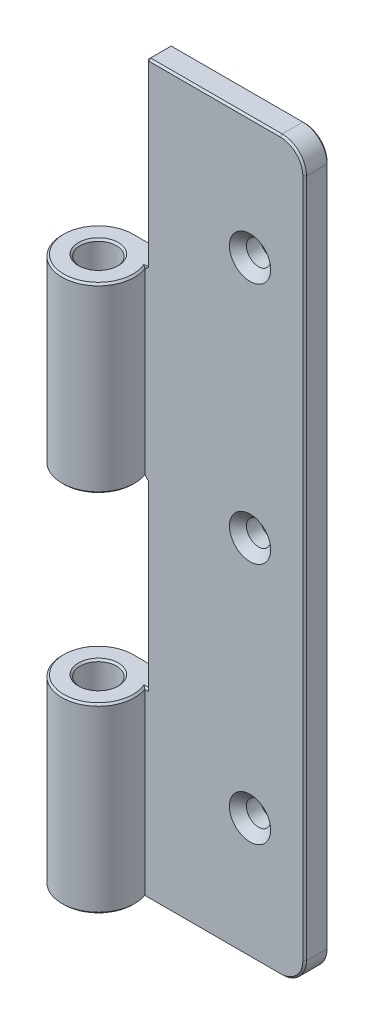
from build123d import *
from build123d.topology import SkipClean

# Parameters (mm, degrees)
SKETCH_1_R          = 3
SKETCH_1_R_2        = 1.5
EXTRUDE_1_DEPTH     = 45
SKETCH_2_W          = 6
SKETCH_2_H          = 15
CUT_EXTRUDE_1_DEPTH = 5
EXTRUDE_2_DEPTH     = 60
SKETCH_6_R          = 1
SKETCH_6_W          = 6
SKETCH_6_H          = 15
CUT_EXTRUDE_2_DEPTH = 5
FILLET_1_R          = 2
CHAMFER_1_SIZE      = 0.7
CHAMFER_2_SIZE      = 0.15


with BuildPart() as part:
    # Sketch 1 → Extrude 1 (new body)
    with BuildSketch(Plane(origin=(0, 0, 0), x_dir=(1, 0, 0), z_dir=(0, 1, 0))):
        with Locations(Location((0, 0, 0), (0, 0, 90))):
            Circle(SKETCH_1_R)
        with Locations(Location((0, 0, 0), (0, 0, 90))):
            Circle(SKETCH_1_R_2, mode=Mode.SUBTRACT)
    extrude(amount=EXTRUDE_1_DEPTH)

    # Sketch 2 → Cut-Extrude 1 (cut, symmetric)
    with BuildSketch(Plane.XY):
        with Locations((0, 22.5)):
            Rectangle(SKETCH_2_W, SKETCH_2_H)
    extrude(amount=CUT_EXTRUDE_1_DEPTH, both=True, mode=Mode.SUBTRACT)


with BuildPart() as cut_extrude_1_piece_1:
    # of the separate pieces the step leaves, piece 1, a body of its own (cut_extrude_1_pieces)
    add(part.part.solids().sort_by_distance((0, 0, -3))[0])



with BuildPart() as cut_extrude_1_piece_2:
    # of the separate pieces the step leaves, piece 2, a body of its own (cut_extrude_1_pieces)
    add(part.part.solids().sort_by_distance((0, 30, -3))[0])


with BuildPart() as cut_extrude_1_piece_1_1:
    with SkipClean():  # the faces are left unmerged after this step: merging them gives an invalid solid
        add(cut_extrude_1_piece_1.part)

        add(cut_extrude_1_piece_2.part)  # Extrude 2 merges Cut-Extrude 1 piece 2
        # Sketch 4 → Extrude 2 (add)
        with BuildSketch(Plane(origin=(0, 0, 0), x_dir=(1, 0, 0), z_dir=(0, 1, 0))):
            with BuildLine():
                Line((0, 3), (16, 3))
                Line((16, 3), (16, 1))
                Line((16, 1), (1.118033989, 1))
                ThreePointArc((1.118033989, 1), (0.612372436, 1.369306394), (0, 1.5))
                Line((0, 1.5), (0, 3))
            make_face()
        extrude(amount=EXTRUDE_2_DEPTH)

    # Sketch 6 → Cut-Extrude 2 (cut, symmetric)
    with BuildSketch(Plane.XY):
        with Locations((11.5, 50)):
            Circle(SKETCH_6_R)
        with Locations((11.5, 30)):
            Circle(SKETCH_6_R)
        with Locations((11.5, 10)):
            Circle(SKETCH_6_R)
        with Locations((0, 52.5)):
            Rectangle(SKETCH_6_W, SKETCH_6_H)
        with Locations((0, 22.5)):
            Rectangle(SKETCH_6_W, SKETCH_6_H)
    extrude(amount=CUT_EXTRUDE_2_DEPTH, both=True, mode=Mode.SUBTRACT)

    # Fillet 1
    fillet_1_edges = [cut_extrude_1_piece_1_1.edges().sort_by_distance(p)[0] for p in [
        (16, 0, -2),
        (16, 60, -2),
    ]]
    fillet(fillet_1_edges, radius=FILLET_1_R)

    # Chamfer 1
    chamfer_1_edges = [cut_extrude_1_piece_1_1.edges().sort_by_distance(p)[0] for p in [
        (10.5, 50, -1),
        (10.5, 30, -1),
        (10.5, 10, -1),
    ]]
    chamfer(chamfer_1_edges, length=CHAMFER_1_SIZE)

    # Chamfer 2
    chamfer_2_edges = [cut_extrude_1_piece_1_1.edges().sort_by_distance(p)[0] for p in [
        (10.5, 50, -3),
        (10.5, 30, -3),
        (10.5, 10, -3),
        (16, 30, -3),
        (16, 30, -1),
        (8.5, 60, -3),
        (7, 0, -3),
        (15.414213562, 59.414213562, -3),
        (15.414213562, 0.585786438, -3),
        (15.414213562, 59.414213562, -1),
        (15.414213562, 0.585786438, -1),
        (0, 15, 1.5),
        (-1.732050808, 15, 2.449489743),
        (-1.732050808, 0, 2.449489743),
        (8.414213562, 0, -1),
        (0, 0, 1.5),
        (0, 45, 1.5),
        (-1.732050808, 30, 2.449489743),
        (-1.732050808, 45, 2.449489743),
        (0, 30, 1.5),
        (8.5, 60, -1),
        (1.5, 45, -3),
        (3, 45, -2),
        (2.914213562, 45, -1),
        (3, 60, -2),
        (3, 52.5, -1),
        (3, 52.5, -3),
        (1.5, 15, -3),
        (2.914213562, 15, -1),
        (1.5, 30, -3),
        (2.914213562, 30, -1),
        (3, 30, -2),
        (3, 22.5, -1),
        (3, 22.5, -3),
    ]]
    chamfer(chamfer_2_edges, length=CHAMFER_2_SIZE)


solid = cut_extrude_1_piece_1_1.part
